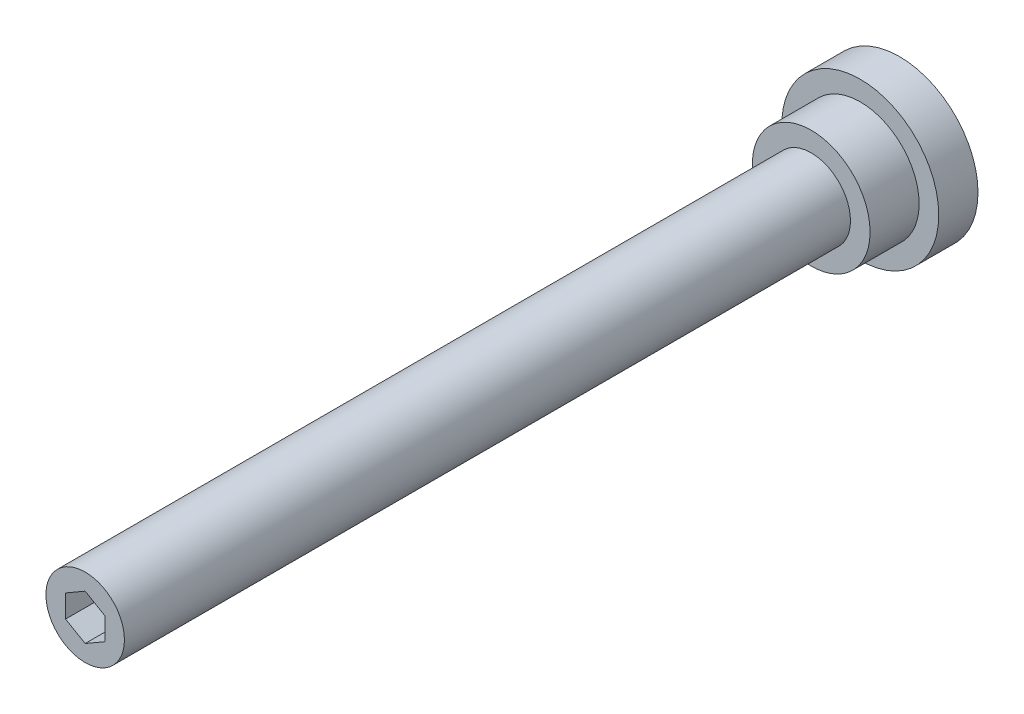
ISO-10303-21;
HEADER;
FILE_DESCRIPTION(('STEP AP214'),'2;1');
FILE_NAME('part.step','',(''),(''),'','','');
FILE_SCHEMA(('AUTOMOTIVE_DESIGN { 1 0 10303 214 1 1 1 1 }'));
ENDSEC;
DATA;
#1=APPLICATION_CONTEXT('core data for automotive mechanical design processes');
#2=APPLICATION_PROTOCOL_DEFINITION('international standard','automotive_design',2000,#1);
#3=PRODUCT_CONTEXT('',#1,'mechanical');
#4=PRODUCT('Part','Part','',(#3));
#5=PRODUCT_RELATED_PRODUCT_CATEGORY('part','',(#4));
#6=PRODUCT_DEFINITION_FORMATION('','',#4);
#7=PRODUCT_DEFINITION_CONTEXT('part definition',#1,'design');
#8=PRODUCT_DEFINITION('design','',#6,#7);
#9=PRODUCT_DEFINITION_SHAPE('','',#8);
#10=(LENGTH_UNIT() NAMED_UNIT(*) SI_UNIT(.MILLI.,.METRE.));
#11=(NAMED_UNIT(*) PLANE_ANGLE_UNIT() SI_UNIT($,.RADIAN.));
#12=(NAMED_UNIT(*) SI_UNIT($,.STERADIAN.) SOLID_ANGLE_UNIT());
#13=UNCERTAINTY_MEASURE_WITH_UNIT(LENGTH_MEASURE(1.E-05),#10,'distance_accuracy_value','');
#14=(GEOMETRIC_REPRESENTATION_CONTEXT(3) GLOBAL_UNCERTAINTY_ASSIGNED_CONTEXT((#13)) GLOBAL_UNIT_ASSIGNED_CONTEXT((#10,
#11,#12)) REPRESENTATION_CONTEXT('',''));
#15=CARTESIAN_POINT('',(0.,0.,0.));
#16=DIRECTION('',(0.,0.,1.));
#17=DIRECTION('',(1.,0.,0.));
#18=AXIS2_PLACEMENT_3D('',#15,#16,#17);
#19=CARTESIAN_POINT('',(0.,0.,83.));
#20=DIRECTION('',(0.,0.,1.));
#21=DIRECTION('',(1.,0.,0.));
#22=AXIS2_PLACEMENT_3D('',#19,#20,#21);
#23=PLANE('',#22);
#24=DIRECTION('',(-0.866025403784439,0.5,0.));
#25=VECTOR('',#24,1.);
#26=CARTESIAN_POINT('',(2.,1.15470053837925,83.));
#27=LINE('',#26,#25);
#28=CARTESIAN_POINT('',(2.,1.15470053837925,83.));
#29=VERTEX_POINT('',#28);
#30=CARTESIAN_POINT('',(0.,2.30940107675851,83.));
#31=VERTEX_POINT('',#30);
#32=EDGE_CURVE('E28',#29,#31,#27,.T.);
#33=ORIENTED_EDGE('',*,*,#32,.F.);
#34=DIRECTION('',(0.,1.,0.));
#35=VECTOR('',#34,1.);
#36=CARTESIAN_POINT('',(2.,-1.15470053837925,83.));
#37=LINE('',#36,#35);
#38=CARTESIAN_POINT('',(2.,-1.15470053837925,83.));
#39=VERTEX_POINT('',#38);
#40=EDGE_CURVE('E111',#39,#29,#37,.T.);
#41=ORIENTED_EDGE('',*,*,#40,.F.);
#42=DIRECTION('',(0.866025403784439,0.5,0.));
#43=VECTOR('',#42,1.);
#44=CARTESIAN_POINT('',(0.,-2.30940107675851,83.));
#45=LINE('',#44,#43);
#46=CARTESIAN_POINT('',(0.,-2.30940107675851,83.));
#47=VERTEX_POINT('',#46);
#48=EDGE_CURVE('E109',#47,#39,#45,.T.);
#49=ORIENTED_EDGE('',*,*,#48,.F.);
#50=DIRECTION('',(0.866025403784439,-0.5,0.));
#51=VECTOR('',#50,1.);
#52=CARTESIAN_POINT('',(-2.,-1.15470053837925,83.));
#53=LINE('',#52,#51);
#54=CARTESIAN_POINT('',(-2.,-1.15470053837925,83.));
#55=VERTEX_POINT('',#54);
#56=EDGE_CURVE('E76',#55,#47,#53,.T.);
#57=ORIENTED_EDGE('',*,*,#56,.F.);
#58=DIRECTION('',(0.,-1.,0.));
#59=VECTOR('',#58,1.);
#60=CARTESIAN_POINT('',(-2.,1.15470053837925,83.));
#61=LINE('',#60,#59);
#62=CARTESIAN_POINT('',(-2.,1.15470053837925,83.));
#63=VERTEX_POINT('',#62);
#64=EDGE_CURVE('E105',#63,#55,#61,.T.);
#65=ORIENTED_EDGE('',*,*,#64,.F.);
#66=DIRECTION('',(-0.866025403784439,-0.5,0.));
#67=VECTOR('',#66,1.);
#68=CARTESIAN_POINT('',(0.,2.30940107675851,83.));
#69=LINE('',#68,#67);
#70=EDGE_CURVE('E102',#31,#63,#69,.T.);
#71=ORIENTED_EDGE('',*,*,#70,.F.);
#72=EDGE_LOOP('',(#33,#41,#49,#57,#65,#71));
#73=FACE_BOUND('',#72,.T.);
#74=CARTESIAN_POINT('',(0.,0.,83.));
#75=DIRECTION('',(0.,0.,1.));
#76=DIRECTION('',(1.,0.,0.));
#77=AXIS2_PLACEMENT_3D('',#74,#75,#76);
#78=CIRCLE('',#77,4.);
#79=CARTESIAN_POINT('',(4.,0.,83.));
#80=VERTEX_POINT('',#79);
#81=EDGE_CURVE('E9',#80,#80,#78,.T.);
#82=ORIENTED_EDGE('',*,*,#81,.T.);
#83=EDGE_LOOP('',(#82));
#84=FACE_BOUND('',#83,.T.);
#85=ADVANCED_FACE('F14',(#73,#84),#23,.T.);
#86=CARTESIAN_POINT('',(0.,0.,30.));
#87=DIRECTION('',(0.,0.,1.));
#88=DIRECTION('',(1.,0.,0.));
#89=AXIS2_PLACEMENT_3D('',#86,#87,#88);
#90=CYLINDRICAL_SURFACE('',#89,4.);
#91=CARTESIAN_POINT('',(0.,0.,9.));
#92=DIRECTION('',(0.,0.,1.));
#93=DIRECTION('',(1.,0.,0.));
#94=AXIS2_PLACEMENT_3D('',#91,#92,#93);
#95=CIRCLE('',#94,4.);
#96=CARTESIAN_POINT('',(4.,0.,9.));
#97=VERTEX_POINT('',#96);
#98=EDGE_CURVE('E21',#97,#97,#95,.T.);
#99=ORIENTED_EDGE('',*,*,#98,.T.);
#100=EDGE_LOOP('',(#99));
#101=FACE_BOUND('',#100,.T.);
#102=ORIENTED_EDGE('',*,*,#81,.F.);
#103=EDGE_LOOP('',(#102));
#104=FACE_BOUND('',#103,.T.);
#105=ADVANCED_FACE('F134',(#101,#104),#90,.T.);
#106=CARTESIAN_POINT('',(-4.,0.,9.));
#107=DIRECTION('',(0.,0.,1.));
#108=DIRECTION('',(1.,0.,0.));
#109=AXIS2_PLACEMENT_3D('',#106,#107,#108);
#110=PLANE('',#109);
#111=CARTESIAN_POINT('',(0.,0.,9.));
#112=DIRECTION('',(0.,0.,1.));
#113=DIRECTION('',(1.,0.,0.));
#114=AXIS2_PLACEMENT_3D('',#111,#112,#113);
#115=CIRCLE('',#114,6.);
#116=CARTESIAN_POINT('',(6.,0.,9.));
#117=VERTEX_POINT('',#116);
#118=EDGE_CURVE('E129',#117,#117,#115,.T.);
#119=ORIENTED_EDGE('',*,*,#118,.T.);
#120=EDGE_LOOP('',(#119));
#121=FACE_BOUND('',#120,.T.);
#122=ORIENTED_EDGE('',*,*,#98,.F.);
#123=EDGE_LOOP('',(#122));
#124=FACE_BOUND('',#123,.T.);
#125=ADVANCED_FACE('F137',(#121,#124),#110,.T.);
#126=CARTESIAN_POINT('',(0.,0.,30.));
#127=DIRECTION('',(0.,0.,1.));
#128=DIRECTION('',(1.,0.,0.));
#129=AXIS2_PLACEMENT_3D('',#126,#127,#128);
#130=CYLINDRICAL_SURFACE('',#129,6.);
#131=CARTESIAN_POINT('',(0.,0.,4.));
#132=DIRECTION('',(0.,0.,1.));
#133=DIRECTION('',(1.,0.,0.));
#134=AXIS2_PLACEMENT_3D('',#131,#132,#133);
#135=CIRCLE('',#134,6.);
#136=CARTESIAN_POINT('',(6.,0.,4.));
#137=VERTEX_POINT('',#136);
#138=EDGE_CURVE('E126',#137,#137,#135,.T.);
#139=ORIENTED_EDGE('',*,*,#138,.T.);
#140=EDGE_LOOP('',(#139));
#141=FACE_BOUND('',#140,.T.);
#142=ORIENTED_EDGE('',*,*,#118,.F.);
#143=EDGE_LOOP('',(#142));
#144=FACE_BOUND('',#143,.T.);
#145=ADVANCED_FACE('F139',(#141,#144),#130,.T.);
#146=CARTESIAN_POINT('',(-6.,0.,4.));
#147=DIRECTION('',(0.,0.,1.));
#148=DIRECTION('',(1.,0.,0.));
#149=AXIS2_PLACEMENT_3D('',#146,#147,#148);
#150=PLANE('',#149);
#151=CARTESIAN_POINT('',(0.,0.,4.));
#152=DIRECTION('',(0.,0.,1.));
#153=DIRECTION('',(1.,0.,0.));
#154=AXIS2_PLACEMENT_3D('',#151,#152,#153);
#155=CIRCLE('',#154,8.);
#156=CARTESIAN_POINT('',(8.,0.,4.));
#157=VERTEX_POINT('',#156);
#158=EDGE_CURVE('E123',#157,#157,#155,.T.);
#159=ORIENTED_EDGE('',*,*,#158,.T.);
#160=EDGE_LOOP('',(#159));
#161=FACE_BOUND('',#160,.T.);
#162=ORIENTED_EDGE('',*,*,#138,.F.);
#163=EDGE_LOOP('',(#162));
#164=FACE_BOUND('',#163,.T.);
#165=ADVANCED_FACE('F147',(#161,#164),#150,.T.);
#166=CARTESIAN_POINT('',(0.,0.,30.));
#167=DIRECTION('',(0.,0.,1.));
#168=DIRECTION('',(1.,0.,0.));
#169=AXIS2_PLACEMENT_3D('',#166,#167,#168);
#170=CYLINDRICAL_SURFACE('',#169,8.);
#171=CARTESIAN_POINT('',(0.,0.,0.));
#172=DIRECTION('',(0.,0.,1.));
#173=DIRECTION('',(1.,0.,0.));
#174=AXIS2_PLACEMENT_3D('',#171,#172,#173);
#175=CIRCLE('',#174,8.);
#176=CARTESIAN_POINT('',(8.,0.,0.));
#177=VERTEX_POINT('',#176);
#178=EDGE_CURVE('E115',#177,#177,#175,.T.);
#179=ORIENTED_EDGE('',*,*,#178,.T.);
#180=EDGE_LOOP('',(#179));
#181=FACE_BOUND('',#180,.T.);
#182=ORIENTED_EDGE('',*,*,#158,.F.);
#183=EDGE_LOOP('',(#182));
#184=FACE_BOUND('',#183,.T.);
#185=ADVANCED_FACE('F172',(#181,#184),#170,.T.);
#186=CARTESIAN_POINT('',(-8.,0.,0.));
#187=DIRECTION('',(0.,0.,-1.));
#188=DIRECTION('',(-1.,0.,0.));
#189=AXIS2_PLACEMENT_3D('',#186,#187,#188);
#190=PLANE('',#189);
#191=ORIENTED_EDGE('',*,*,#178,.F.);
#192=EDGE_LOOP('',(#191));
#193=FACE_BOUND('',#192,.T.);
#194=ADVANCED_FACE('F165',(#193),#190,.T.);
#195=CARTESIAN_POINT('',(2.,1.15470053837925,79.));
#196=DIRECTION('',(0.5,0.866025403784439,0.));
#197=DIRECTION('',(-0.866025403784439,0.5,0.));
#198=AXIS2_PLACEMENT_3D('',#195,#196,#197);
#199=PLANE('',#198);
#200=ORIENTED_EDGE('',*,*,#32,.T.);
#201=DIRECTION('',(0.,0.,1.));
#202=VECTOR('',#201,1.);
#203=CARTESIAN_POINT('',(0.,2.30940107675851,79.));
#204=LINE('',#203,#202);
#205=CARTESIAN_POINT('',(0.,2.30940107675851,79.));
#206=VERTEX_POINT('',#205);
#207=EDGE_CURVE('E58',#206,#31,#204,.T.);
#208=ORIENTED_EDGE('',*,*,#207,.F.);
#209=DIRECTION('',(-0.866025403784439,0.5,0.));
#210=VECTOR('',#209,1.);
#211=CARTESIAN_POINT('',(2.,1.15470053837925,79.));
#212=LINE('',#211,#210);
#213=CARTESIAN_POINT('',(2.,1.15470053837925,79.));
#214=VERTEX_POINT('',#213);
#215=EDGE_CURVE('E113',#214,#206,#212,.T.);
#216=ORIENTED_EDGE('',*,*,#215,.F.);
#217=DIRECTION('',(0.,0.,1.));
#218=VECTOR('',#217,1.);
#219=CARTESIAN_POINT('',(2.,1.15470053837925,79.));
#220=LINE('',#219,#218);
#221=EDGE_CURVE('E36',#214,#29,#220,.T.);
#222=ORIENTED_EDGE('',*,*,#221,.T.);
#223=EDGE_LOOP('',(#200,#208,#216,#222));
#224=FACE_BOUND('',#223,.T.);
#225=ADVANCED_FACE('F162',(#224),#199,.F.);
#226=CARTESIAN_POINT('',(2.,-1.15470053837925,79.));
#227=DIRECTION('',(1.,0.,0.));
#228=DIRECTION('',(0.,1.,0.));
#229=AXIS2_PLACEMENT_3D('',#226,#227,#228);
#230=PLANE('',#229);
#231=ORIENTED_EDGE('',*,*,#40,.T.);
#232=ORIENTED_EDGE('',*,*,#221,.F.);
#233=DIRECTION('',(0.,1.,0.));
#234=VECTOR('',#233,1.);
#235=CARTESIAN_POINT('',(2.,-1.15470053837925,79.));
#236=LINE('',#235,#234);
#237=CARTESIAN_POINT('',(2.,-1.15470053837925,79.));
#238=VERTEX_POINT('',#237);
#239=EDGE_CURVE('E88',#238,#214,#236,.T.);
#240=ORIENTED_EDGE('',*,*,#239,.F.);
#241=DIRECTION('',(0.,0.,1.));
#242=VECTOR('',#241,1.);
#243=CARTESIAN_POINT('',(2.,-1.15470053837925,79.));
#244=LINE('',#243,#242);
#245=EDGE_CURVE('E80',#238,#39,#244,.T.);
#246=ORIENTED_EDGE('',*,*,#245,.T.);
#247=EDGE_LOOP('',(#231,#232,#240,#246));
#248=FACE_BOUND('',#247,.T.);
#249=ADVANCED_FACE('F164',(#248),#230,.F.);
#250=CARTESIAN_POINT('',(0.,-2.30940107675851,79.));
#251=DIRECTION('',(0.5,-0.866025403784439,0.));
#252=DIRECTION('',(0.866025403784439,0.5,0.));
#253=AXIS2_PLACEMENT_3D('',#250,#251,#252);
#254=PLANE('',#253);
#255=ORIENTED_EDGE('',*,*,#48,.T.);
#256=ORIENTED_EDGE('',*,*,#245,.F.);
#257=DIRECTION('',(0.866025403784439,0.5,0.));
#258=VECTOR('',#257,1.);
#259=CARTESIAN_POINT('',(0.,-2.30940107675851,79.));
#260=LINE('',#259,#258);
#261=CARTESIAN_POINT('',(0.,-2.30940107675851,79.));
#262=VERTEX_POINT('',#261);
#263=EDGE_CURVE('E84',#262,#238,#260,.T.);
#264=ORIENTED_EDGE('',*,*,#263,.F.);
#265=DIRECTION('',(0.,0.,1.));
#266=VECTOR('',#265,1.);
#267=CARTESIAN_POINT('',(0.,-2.30940107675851,79.));
#268=LINE('',#267,#266);
#269=EDGE_CURVE('E69',#262,#47,#268,.T.);
#270=ORIENTED_EDGE('',*,*,#269,.T.);
#271=EDGE_LOOP('',(#255,#256,#264,#270));
#272=FACE_BOUND('',#271,.T.);
#273=ADVANCED_FACE('F85',(#272),#254,.F.);
#274=CARTESIAN_POINT('',(-2.,-1.15470053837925,79.));
#275=DIRECTION('',(-0.5,-0.866025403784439,0.));
#276=DIRECTION('',(0.866025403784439,-0.5,0.));
#277=AXIS2_PLACEMENT_3D('',#274,#275,#276);
#278=PLANE('',#277);
#279=ORIENTED_EDGE('',*,*,#56,.T.);
#280=ORIENTED_EDGE('',*,*,#269,.F.);
#281=DIRECTION('',(0.866025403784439,-0.5,0.));
#282=VECTOR('',#281,1.);
#283=CARTESIAN_POINT('',(-2.,-1.15470053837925,79.));
#284=LINE('',#283,#282);
#285=CARTESIAN_POINT('',(-2.,-1.15470053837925,79.));
#286=VERTEX_POINT('',#285);
#287=EDGE_CURVE('E73',#286,#262,#284,.T.);
#288=ORIENTED_EDGE('',*,*,#287,.F.);
#289=DIRECTION('',(0.,0.,1.));
#290=VECTOR('',#289,1.);
#291=CARTESIAN_POINT('',(-2.,-1.15470053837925,79.));
#292=LINE('',#291,#290);
#293=EDGE_CURVE('E81',#286,#55,#292,.T.);
#294=ORIENTED_EDGE('',*,*,#293,.T.);
#295=EDGE_LOOP('',(#279,#280,#288,#294));
#296=FACE_BOUND('',#295,.T.);
#297=ADVANCED_FACE('F71',(#296),#278,.F.);
#298=CARTESIAN_POINT('',(-2.,1.15470053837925,79.));
#299=DIRECTION('',(-1.,0.,0.));
#300=DIRECTION('',(0.,-1.,0.));
#301=AXIS2_PLACEMENT_3D('',#298,#299,#300);
#302=PLANE('',#301);
#303=ORIENTED_EDGE('',*,*,#64,.T.);
#304=ORIENTED_EDGE('',*,*,#293,.F.);
#305=DIRECTION('',(0.,-1.,0.));
#306=VECTOR('',#305,1.);
#307=CARTESIAN_POINT('',(-2.,1.15470053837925,79.));
#308=LINE('',#307,#306);
#309=CARTESIAN_POINT('',(-2.,1.15470053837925,79.));
#310=VERTEX_POINT('',#309);
#311=EDGE_CURVE('E94',#310,#286,#308,.T.);
#312=ORIENTED_EDGE('',*,*,#311,.F.);
#313=DIRECTION('',(0.,0.,1.));
#314=VECTOR('',#313,1.);
#315=CARTESIAN_POINT('',(-2.,1.15470053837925,79.));
#316=LINE('',#315,#314);
#317=EDGE_CURVE('E118',#310,#63,#316,.T.);
#318=ORIENTED_EDGE('',*,*,#317,.T.);
#319=EDGE_LOOP('',(#303,#304,#312,#318));
#320=FACE_BOUND('',#319,.T.);
#321=ADVANCED_FACE('F237',(#320),#302,.F.);
#322=CARTESIAN_POINT('',(0.,2.30940107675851,79.));
#323=DIRECTION('',(-0.5,0.866025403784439,0.));
#324=DIRECTION('',(-0.866025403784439,-0.5,0.));
#325=AXIS2_PLACEMENT_3D('',#322,#323,#324);
#326=PLANE('',#325);
#327=ORIENTED_EDGE('',*,*,#70,.T.);
#328=ORIENTED_EDGE('',*,*,#317,.F.);
#329=DIRECTION('',(-0.866025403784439,-0.5,0.));
#330=VECTOR('',#329,1.);
#331=CARTESIAN_POINT('',(0.,2.30940107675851,79.));
#332=LINE('',#331,#330);
#333=EDGE_CURVE('E96',#206,#310,#332,.T.);
#334=ORIENTED_EDGE('',*,*,#333,.F.);
#335=ORIENTED_EDGE('',*,*,#207,.T.);
#336=EDGE_LOOP('',(#327,#328,#334,#335));
#337=FACE_BOUND('',#336,.T.);
#338=ADVANCED_FACE('F160',(#337),#326,.F.);
#339=CARTESIAN_POINT('',(0.,2.30940107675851,79.));
#340=DIRECTION('',(0.,0.,1.));
#341=DIRECTION('',(1.,0.,0.));
#342=AXIS2_PLACEMENT_3D('',#339,#340,#341);
#343=PLANE('',#342);
#344=ORIENTED_EDGE('',*,*,#215,.T.);
#345=ORIENTED_EDGE('',*,*,#333,.T.);
#346=ORIENTED_EDGE('',*,*,#311,.T.);
#347=ORIENTED_EDGE('',*,*,#287,.T.);
#348=ORIENTED_EDGE('',*,*,#263,.T.);
#349=ORIENTED_EDGE('',*,*,#239,.T.);
#350=EDGE_LOOP('',(#344,#345,#346,#347,#348,#349));
#351=FACE_BOUND('',#350,.T.);
#352=ADVANCED_FACE('F91',(#351),#343,.T.);
#353=CLOSED_SHELL('',(#85,#105,#125,#145,#165,#185,#194,#225,#249,#273,#297,#321,#338,#352));
#354=MANIFOLD_SOLID_BREP('B1',#353);
#355=ADVANCED_BREP_SHAPE_REPRESENTATION('',(#18,#354),#14);
#356=SHAPE_DEFINITION_REPRESENTATION(#9,#355);
ENDSEC;
END-ISO-10303-21;
